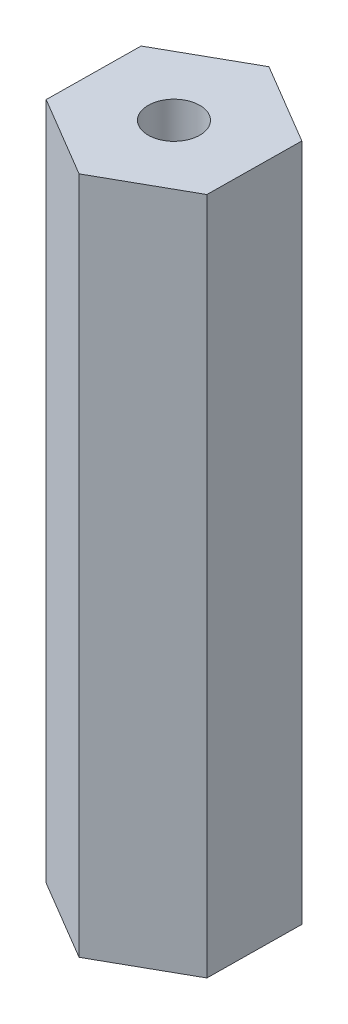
from build123d import *

# Parameters (mm, degrees)
SKETCH2_R           = 2.0193
BOSS_EXTRUDE4_DEPTH = 52.9971


with BuildPart() as part:
    # Sketch2 → Boss-Extrude4 (new body)
    with BuildSketch(Plane(origin=(0, 0, 0), x_dir=(1, 0, 0), z_dir=(0, 1, 0))):
        Polygon((6.307463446, -3.738881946), (6.39169847, 3.592982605), (0.084235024, 7.331864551), (-6.307463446, 3.738881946), (-6.39169847, -3.592982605), (-0.084235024, -7.331864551), align=None)
        with Locations(Location((0, 0, 0), (0, 0, 90))):
            Circle(SKETCH2_R, mode=Mode.SUBTRACT)
    extrude(amount=BOSS_EXTRUDE4_DEPTH)


solid = part.part
